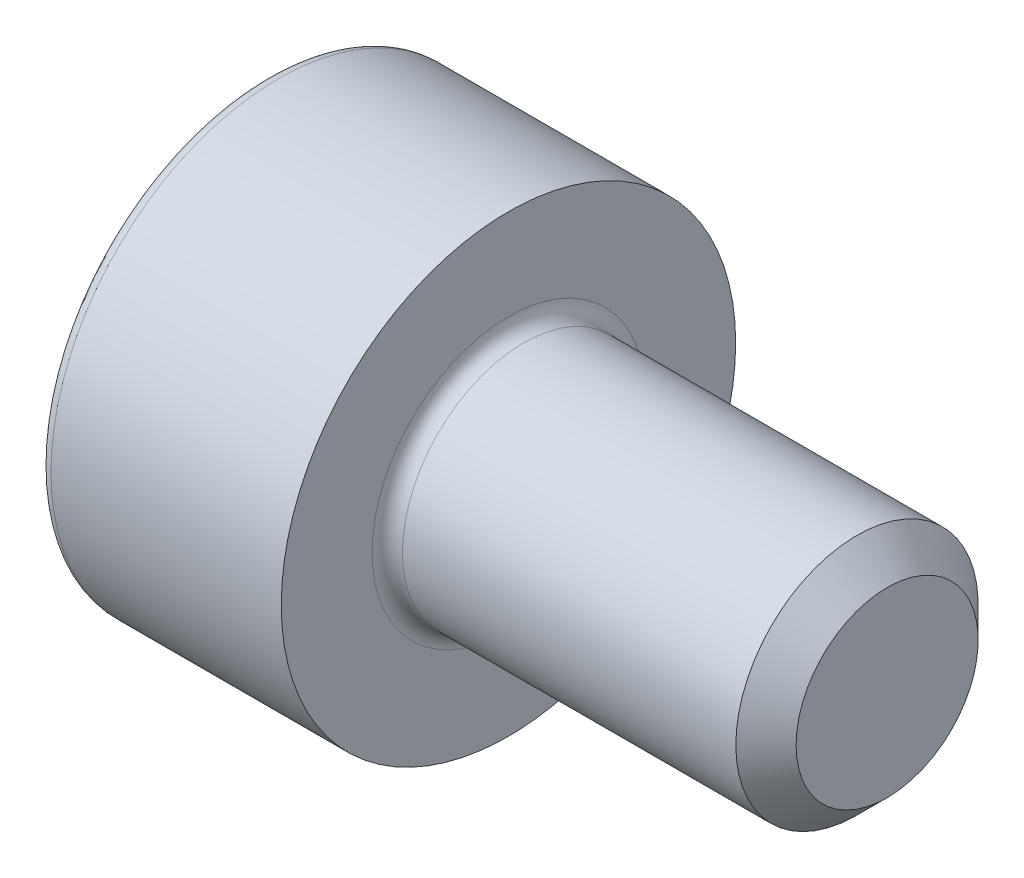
ISO-10303-21;
HEADER;
FILE_DESCRIPTION(('STEP AP214'),'2;1');
FILE_NAME('part.step','',(''),(''),'','','');
FILE_SCHEMA(('AUTOMOTIVE_DESIGN { 1 0 10303 214 1 1 1 1 }'));
ENDSEC;
DATA;
#1=APPLICATION_CONTEXT('core data for automotive mechanical design processes');
#2=APPLICATION_PROTOCOL_DEFINITION('international standard','automotive_design',2000,#1);
#3=PRODUCT_CONTEXT('',#1,'mechanical');
#4=PRODUCT('Part','Part','',(#3));
#5=PRODUCT_RELATED_PRODUCT_CATEGORY('part','',(#4));
#6=PRODUCT_DEFINITION_FORMATION('','',#4);
#7=PRODUCT_DEFINITION_CONTEXT('part definition',#1,'design');
#8=PRODUCT_DEFINITION('design','',#6,#7);
#9=PRODUCT_DEFINITION_SHAPE('','',#8);
#10=(LENGTH_UNIT() NAMED_UNIT(*) SI_UNIT(.MILLI.,.METRE.));
#11=(NAMED_UNIT(*) PLANE_ANGLE_UNIT() SI_UNIT($,.RADIAN.));
#12=(NAMED_UNIT(*) SI_UNIT($,.STERADIAN.) SOLID_ANGLE_UNIT());
#13=UNCERTAINTY_MEASURE_WITH_UNIT(LENGTH_MEASURE(1.E-05),#10,'distance_accuracy_value','');
#14=(GEOMETRIC_REPRESENTATION_CONTEXT(3) GLOBAL_UNCERTAINTY_ASSIGNED_CONTEXT((#13)) GLOBAL_UNIT_ASSIGNED_CONTEXT((#10,
#11,#12)) REPRESENTATION_CONTEXT('',''));
#15=CARTESIAN_POINT('',(0.,0.,0.));
#16=DIRECTION('',(0.,0.,1.));
#17=DIRECTION('',(1.,0.,0.));
#18=AXIS2_PLACEMENT_3D('',#15,#16,#17);
#19=CARTESIAN_POINT('',(0.7,1.29903810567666,0.75));
#20=DIRECTION('',(1.,0.,0.));
#21=DIRECTION('',(0.,0.,-1.));
#22=AXIS2_PLACEMENT_3D('',#19,#20,#21);
#23=PLANE('',#22);
#24=CARTESIAN_POINT('',(0.7,0.,0.));
#25=DIRECTION('',(1.,0.,0.));
#26=DIRECTION('',(0.,0.,-1.));
#27=AXIS2_PLACEMENT_3D('',#24,#25,#26);
#28=CIRCLE('',#27,0.75);
#29=CARTESIAN_POINT('',(0.7,0.,-0.75));
#30=VERTEX_POINT('',#29);
#31=CARTESIAN_POINT('',(0.7,-0.649519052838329,-0.375));
#32=VERTEX_POINT('',#31);
#33=EDGE_CURVE('E11',#30,#32,#28,.F.);
#34=ORIENTED_EDGE('',*,*,#33,.F.);
#35=DIRECTION('',(0.,1.,0.));
#36=VECTOR('',#35,1.);
#37=CARTESIAN_POINT('',(0.7,-0.43301270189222,-0.75));
#38=LINE('',#37,#36);
#39=CARTESIAN_POINT('',(0.7,-0.43301270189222,-0.75));
#40=VERTEX_POINT('',#39);
#41=EDGE_CURVE('E177',#40,#30,#38,.T.);
#42=ORIENTED_EDGE('',*,*,#41,.F.);
#43=DIRECTION('',(0.,0.5,-0.866025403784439));
#44=VECTOR('',#43,1.);
#45=CARTESIAN_POINT('',(0.7,-0.866025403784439,0.));
#46=LINE('',#45,#44);
#47=EDGE_CURVE('E173',#32,#40,#46,.T.);
#48=ORIENTED_EDGE('',*,*,#47,.F.);
#49=EDGE_LOOP('',(#34,#42,#48));
#50=FACE_BOUND('',#49,.T.);
#51=ADVANCED_FACE('F33',(#50),#23,.F.);
#52=CARTESIAN_POINT('',(0.7,-0.649519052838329,0.375));
#53=VERTEX_POINT('',#52);
#54=EDGE_CURVE('E42',#32,#53,#28,.F.);
#55=ORIENTED_EDGE('',*,*,#54,.F.);
#56=CARTESIAN_POINT('',(0.7,-0.866025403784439,0.));
#57=VERTEX_POINT('',#56);
#58=EDGE_CURVE('E174',#57,#32,#46,.T.);
#59=ORIENTED_EDGE('',*,*,#58,.F.);
#60=DIRECTION('',(0.,-0.5,-0.866025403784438));
#61=VECTOR('',#60,1.);
#62=CARTESIAN_POINT('',(0.7,-0.433012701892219,0.75));
#63=LINE('',#62,#61);
#64=EDGE_CURVE('E169',#53,#57,#63,.T.);
#65=ORIENTED_EDGE('',*,*,#64,.F.);
#66=EDGE_LOOP('',(#55,#59,#65));
#67=FACE_BOUND('',#66,.T.);
#68=ADVANCED_FACE('F117',(#67),#23,.F.);
#69=CARTESIAN_POINT('',(0.7,0.,0.75));
#70=VERTEX_POINT('',#69);
#71=EDGE_CURVE('E253',#53,#70,#28,.F.);
#72=ORIENTED_EDGE('',*,*,#71,.F.);
#73=CARTESIAN_POINT('',(0.7,-0.433012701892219,0.75));
#74=VERTEX_POINT('',#73);
#75=EDGE_CURVE('E170',#74,#53,#63,.T.);
#76=ORIENTED_EDGE('',*,*,#75,.F.);
#77=DIRECTION('',(0.,-1.,0.));
#78=VECTOR('',#77,1.);
#79=CARTESIAN_POINT('',(0.7,0.433012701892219,0.75));
#80=LINE('',#79,#78);
#81=EDGE_CURVE('E165',#70,#74,#80,.T.);
#82=ORIENTED_EDGE('',*,*,#81,.F.);
#83=EDGE_LOOP('',(#72,#76,#82));
#84=FACE_BOUND('',#83,.T.);
#85=ADVANCED_FACE('F123',(#84),#23,.F.);
#86=CARTESIAN_POINT('',(0.7,0.,0.));
#87=DIRECTION('',(-1.,0.,0.));
#88=DIRECTION('',(0.,0.,1.));
#89=AXIS2_PLACEMENT_3D('',#86,#87,#88);
#90=CIRCLE('',#89,0.75);
#91=CARTESIAN_POINT('',(0.7,0.649519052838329,0.375));
#92=VERTEX_POINT('',#91);
#93=EDGE_CURVE('E163',#70,#92,#90,.T.);
#94=ORIENTED_EDGE('',*,*,#93,.F.);
#95=CARTESIAN_POINT('',(0.7,0.433012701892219,0.75));
#96=VERTEX_POINT('',#95);
#97=EDGE_CURVE('E166',#96,#70,#80,.T.);
#98=ORIENTED_EDGE('',*,*,#97,.F.);
#99=DIRECTION('',(0.,-0.5,0.866025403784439));
#100=VECTOR('',#99,1.);
#101=CARTESIAN_POINT('',(0.7,0.866025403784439,0.));
#102=LINE('',#101,#100);
#103=EDGE_CURVE('E160',#92,#96,#102,.T.);
#104=ORIENTED_EDGE('',*,*,#103,.F.);
#105=EDGE_LOOP('',(#94,#98,#104));
#106=FACE_BOUND('',#105,.T.);
#107=ADVANCED_FACE('F137',(#106),#23,.F.);
#108=CARTESIAN_POINT('',(0.7,0.649519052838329,-0.375));
#109=VERTEX_POINT('',#108);
#110=EDGE_CURVE('E49',#92,#109,#28,.F.);
#111=ORIENTED_EDGE('',*,*,#110,.F.);
#112=CARTESIAN_POINT('',(0.7,0.866025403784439,0.));
#113=VERTEX_POINT('',#112);
#114=EDGE_CURVE('E151',#113,#92,#102,.T.);
#115=ORIENTED_EDGE('',*,*,#114,.F.);
#116=DIRECTION('',(0.,0.5,0.866025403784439));
#117=VECTOR('',#116,1.);
#118=CARTESIAN_POINT('',(0.7,0.43301270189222,-0.75));
#119=LINE('',#118,#117);
#120=EDGE_CURVE('E148',#109,#113,#119,.T.);
#121=ORIENTED_EDGE('',*,*,#120,.F.);
#122=EDGE_LOOP('',(#111,#115,#121));
#123=FACE_BOUND('',#122,.T.);
#124=ADVANCED_FACE('F128',(#123),#23,.F.);
#125=EDGE_CURVE('E37',#109,#30,#28,.F.);
#126=ORIENTED_EDGE('',*,*,#125,.F.);
#127=CARTESIAN_POINT('',(0.7,0.43301270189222,-0.75));
#128=VERTEX_POINT('',#127);
#129=EDGE_CURVE('E143',#128,#109,#119,.T.);
#130=ORIENTED_EDGE('',*,*,#129,.F.);
#131=EDGE_CURVE('E144',#30,#128,#38,.T.);
#132=ORIENTED_EDGE('',*,*,#131,.F.);
#133=EDGE_LOOP('',(#126,#130,#132));
#134=FACE_BOUND('',#133,.T.);
#135=ADVANCED_FACE('F119',(#134),#23,.F.);
#136=CARTESIAN_POINT('',(0.,0.,0.));
#137=DIRECTION('',(1.,0.,0.));
#138=DIRECTION('',(0.,0.,-1.));
#139=AXIS2_PLACEMENT_3D('',#136,#137,#138);
#140=PLANE('',#139);
#141=CARTESIAN_POINT('',(0.,0.,0.));
#142=DIRECTION('',(1.,0.,0.));
#143=DIRECTION('',(0.,0.,-1.));
#144=AXIS2_PLACEMENT_3D('',#141,#142,#143);
#145=CIRCLE('',#144,1.42);
#146=CARTESIAN_POINT('',(0.,0.,-1.42));
#147=VERTEX_POINT('',#146);
#148=EDGE_CURVE('E220',#147,#147,#145,.F.);
#149=ORIENTED_EDGE('',*,*,#148,.T.);
#150=EDGE_LOOP('',(#149));
#151=FACE_BOUND('',#150,.T.);
#152=DIRECTION('',(0.,0.5,0.866025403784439));
#153=VECTOR('',#152,1.);
#154=CARTESIAN_POINT('',(0.,0.43301270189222,-0.75));
#155=LINE('',#154,#153);
#156=CARTESIAN_POINT('',(0.,0.43301270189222,-0.75));
#157=VERTEX_POINT('',#156);
#158=CARTESIAN_POINT('',(0.,0.866025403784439,0.));
#159=VERTEX_POINT('',#158);
#160=EDGE_CURVE('E179',#157,#159,#155,.T.);
#161=ORIENTED_EDGE('',*,*,#160,.T.);
#162=DIRECTION('',(0.,-0.5,0.866025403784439));
#163=VECTOR('',#162,1.);
#164=CARTESIAN_POINT('',(0.,0.866025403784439,0.));
#165=LINE('',#164,#163);
#166=CARTESIAN_POINT('',(0.,0.433012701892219,0.75));
#167=VERTEX_POINT('',#166);
#168=EDGE_CURVE('E181',#159,#167,#165,.T.);
#169=ORIENTED_EDGE('',*,*,#168,.T.);
#170=DIRECTION('',(0.,-1.,0.));
#171=VECTOR('',#170,1.);
#172=CARTESIAN_POINT('',(0.,0.433012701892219,0.75));
#173=LINE('',#172,#171);
#174=CARTESIAN_POINT('',(0.,-0.433012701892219,0.75));
#175=VERTEX_POINT('',#174);
#176=EDGE_CURVE('E183',#167,#175,#173,.T.);
#177=ORIENTED_EDGE('',*,*,#176,.T.);
#178=DIRECTION('',(0.,-0.5,-0.866025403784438));
#179=VECTOR('',#178,1.);
#180=CARTESIAN_POINT('',(0.,-0.433012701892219,0.75));
#181=LINE('',#180,#179);
#182=CARTESIAN_POINT('',(0.,-0.866025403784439,0.));
#183=VERTEX_POINT('',#182);
#184=EDGE_CURVE('E185',#175,#183,#181,.T.);
#185=ORIENTED_EDGE('',*,*,#184,.T.);
#186=DIRECTION('',(0.,0.5,-0.866025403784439));
#187=VECTOR('',#186,1.);
#188=CARTESIAN_POINT('',(0.,-0.866025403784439,0.));
#189=LINE('',#188,#187);
#190=CARTESIAN_POINT('',(0.,-0.43301270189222,-0.75));
#191=VERTEX_POINT('',#190);
#192=EDGE_CURVE('E187',#183,#191,#189,.T.);
#193=ORIENTED_EDGE('',*,*,#192,.T.);
#194=DIRECTION('',(0.,1.,0.));
#195=VECTOR('',#194,1.);
#196=CARTESIAN_POINT('',(0.,-0.43301270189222,-0.75));
#197=LINE('',#196,#195);
#198=EDGE_CURVE('E57',#191,#157,#197,.T.);
#199=ORIENTED_EDGE('',*,*,#198,.T.);
#200=EDGE_LOOP('',(#161,#169,#177,#185,#193,#199));
#201=FACE_BOUND('',#200,.T.);
#202=ADVANCED_FACE('F127',(#151,#201),#140,.F.);
#203=CARTESIAN_POINT('',(0.,0.,0.));
#204=DIRECTION('',(-1.,0.,0.));
#205=DIRECTION('',(0.,0.,1.));
#206=AXIS2_PLACEMENT_3D('',#203,#204,#205);
#207=CYLINDRICAL_SURFACE('',#206,1.5);
#208=CARTESIAN_POINT('',(0.08,0.,0.));
#209=DIRECTION('',(1.,0.,0.));
#210=DIRECTION('',(0.,0.,-1.));
#211=AXIS2_PLACEMENT_3D('',#208,#209,#210);
#212=CIRCLE('',#211,1.5);
#213=CARTESIAN_POINT('',(0.08,0.,-1.5));
#214=VERTEX_POINT('',#213);
#215=EDGE_CURVE('E146',#214,#214,#212,.T.);
#216=ORIENTED_EDGE('',*,*,#215,.T.);
#217=EDGE_LOOP('',(#216));
#218=FACE_BOUND('',#217,.T.);
#219=CARTESIAN_POINT('',(1.6,0.,0.));
#220=DIRECTION('',(-1.,0.,0.));
#221=DIRECTION('',(0.,0.,1.));
#222=AXIS2_PLACEMENT_3D('',#219,#220,#221);
#223=CIRCLE('',#222,1.5);
#224=CARTESIAN_POINT('',(1.6,0.,1.5));
#225=VERTEX_POINT('',#224);
#226=EDGE_CURVE('E211',#225,#225,#223,.T.);
#227=ORIENTED_EDGE('',*,*,#226,.T.);
#228=EDGE_LOOP('',(#227));
#229=FACE_BOUND('',#228,.T.);
#230=ADVANCED_FACE('F134',(#218,#229),#207,.T.);
#231=CARTESIAN_POINT('',(1.6,1.5,0.));
#232=DIRECTION('',(-1.,0.,0.));
#233=DIRECTION('',(0.,0.,1.));
#234=AXIS2_PLACEMENT_3D('',#231,#232,#233);
#235=PLANE('',#234);
#236=CARTESIAN_POINT('',(1.6,0.,0.));
#237=DIRECTION('',(-1.,0.,0.));
#238=DIRECTION('',(0.,0.,1.));
#239=AXIS2_PLACEMENT_3D('',#236,#237,#238);
#240=CIRCLE('',#239,0.9);
#241=CARTESIAN_POINT('',(1.6,0.,0.9));
#242=VERTEX_POINT('',#241);
#243=EDGE_CURVE('E214',#242,#242,#240,.T.);
#244=ORIENTED_EDGE('',*,*,#243,.T.);
#245=EDGE_LOOP('',(#244));
#246=FACE_BOUND('',#245,.T.);
#247=ORIENTED_EDGE('',*,*,#226,.F.);
#248=EDGE_LOOP('',(#247));
#249=FACE_BOUND('',#248,.T.);
#250=ADVANCED_FACE('F362',(#246,#249),#235,.F.);
#251=CARTESIAN_POINT('',(0.,0.,0.));
#252=DIRECTION('',(-1.,0.,0.));
#253=DIRECTION('',(0.,0.,1.));
#254=AXIS2_PLACEMENT_3D('',#251,#252,#253);
#255=CYLINDRICAL_SURFACE('',#254,0.8);
#256=CARTESIAN_POINT('',(1.7,0.,0.));
#257=DIRECTION('',(-1.,0.,0.));
#258=DIRECTION('',(0.,0.,1.));
#259=AXIS2_PLACEMENT_3D('',#256,#257,#258);
#260=CIRCLE('',#259,0.8);
#261=CARTESIAN_POINT('',(1.7,0.,0.8));
#262=VERTEX_POINT('',#261);
#263=EDGE_CURVE('E217',#262,#262,#260,.F.);
#264=ORIENTED_EDGE('',*,*,#263,.T.);
#265=EDGE_LOOP('',(#264));
#266=FACE_BOUND('',#265,.T.);
#267=CARTESIAN_POINT('',(3.901,0.,0.));
#268=DIRECTION('',(-1.,0.,0.));
#269=DIRECTION('',(0.,0.,1.));
#270=AXIS2_PLACEMENT_3D('',#267,#268,#269);
#271=CIRCLE('',#270,0.8);
#272=CARTESIAN_POINT('',(3.901,0.,0.8));
#273=VERTEX_POINT('',#272);
#274=EDGE_CURVE('E208',#273,#273,#271,.T.);
#275=ORIENTED_EDGE('',*,*,#274,.T.);
#276=EDGE_LOOP('',(#275));
#277=FACE_BOUND('',#276,.T.);
#278=ADVANCED_FACE('F378',(#266,#277),#255,.T.);
#279=CARTESIAN_POINT('',(4.1,0.,0.));
#280=DIRECTION('',(-1.,0.,0.));
#281=DIRECTION('',(0.,0.,1.));
#282=AXIS2_PLACEMENT_3D('',#279,#280,#281);
#283=CONICAL_SURFACE('',#282,0.601,0.785398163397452);
#284=ORIENTED_EDGE('',*,*,#274,.F.);
#285=EDGE_LOOP('',(#284));
#286=FACE_BOUND('',#285,.T.);
#287=CARTESIAN_POINT('',(4.1,0.,0.));
#288=DIRECTION('',(-1.,0.,0.));
#289=DIRECTION('',(0.,0.,1.));
#290=AXIS2_PLACEMENT_3D('',#287,#288,#289);
#291=CIRCLE('',#290,0.601);
#292=CARTESIAN_POINT('',(4.1,0.,0.601));
#293=VERTEX_POINT('',#292);
#294=EDGE_CURVE('E205',#293,#293,#291,.T.);
#295=ORIENTED_EDGE('',*,*,#294,.T.);
#296=EDGE_LOOP('',(#295));
#297=FACE_BOUND('',#296,.T.);
#298=ADVANCED_FACE('F383',(#286,#297),#283,.T.);
#299=CARTESIAN_POINT('',(4.1,0.601,0.));
#300=DIRECTION('',(-1.,0.,0.));
#301=DIRECTION('',(0.,0.,1.));
#302=AXIS2_PLACEMENT_3D('',#299,#300,#301);
#303=PLANE('',#302);
#304=ORIENTED_EDGE('',*,*,#294,.F.);
#305=EDGE_LOOP('',(#304));
#306=FACE_BOUND('',#305,.T.);
#307=ADVANCED_FACE('F371',(#306),#303,.F.);
#308=CARTESIAN_POINT('',(1.7,0.,0.));
#309=DIRECTION('',(-1.,0.,0.));
#310=DIRECTION('',(0.,0.,1.));
#311=AXIS2_PLACEMENT_3D('',#308,#309,#310);
#312=TOROIDAL_SURFACE('',#311,0.9,0.1);
#313=ORIENTED_EDGE('',*,*,#263,.F.);
#314=EDGE_LOOP('',(#313));
#315=FACE_BOUND('',#314,.T.);
#316=ORIENTED_EDGE('',*,*,#243,.F.);
#317=EDGE_LOOP('',(#316));
#318=FACE_BOUND('',#317,.T.);
#319=ADVANCED_FACE('F229',(#315,#318),#312,.F.);
#320=CARTESIAN_POINT('',(0.08,0.,0.));
#321=DIRECTION('',(1.,0.,0.));
#322=DIRECTION('',(0.,0.,-1.));
#323=AXIS2_PLACEMENT_3D('',#320,#321,#322);
#324=TOROIDAL_SURFACE('',#323,1.42,0.08);
#325=ORIENTED_EDGE('',*,*,#215,.F.);
#326=EDGE_LOOP('',(#325));
#327=FACE_BOUND('',#326,.T.);
#328=ORIENTED_EDGE('',*,*,#148,.F.);
#329=EDGE_LOOP('',(#328));
#330=FACE_BOUND('',#329,.T.);
#331=ADVANCED_FACE('F35',(#327,#330),#324,.T.);
#332=CARTESIAN_POINT('',(0.7,0.43301270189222,-0.75));
#333=DIRECTION('',(0.,-0.866025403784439,0.5));
#334=DIRECTION('',(0.,-0.5,-0.866025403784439));
#335=AXIS2_PLACEMENT_3D('',#332,#333,#334);
#336=PLANE('',#335);
#337=ORIENTED_EDGE('',*,*,#129,.T.);
#338=ORIENTED_EDGE('',*,*,#120,.T.);
#339=DIRECTION('',(-1.,0.,0.));
#340=VECTOR('',#339,1.);
#341=CARTESIAN_POINT('',(0.7,0.866025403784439,0.));
#342=LINE('',#341,#340);
#343=EDGE_CURVE('E203',#113,#159,#342,.T.);
#344=ORIENTED_EDGE('',*,*,#343,.T.);
#345=ORIENTED_EDGE('',*,*,#160,.F.);
#346=DIRECTION('',(-1.,0.,0.));
#347=VECTOR('',#346,1.);
#348=CARTESIAN_POINT('',(0.7,0.43301270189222,-0.75));
#349=LINE('',#348,#347);
#350=EDGE_CURVE('E159',#128,#157,#349,.T.);
#351=ORIENTED_EDGE('',*,*,#350,.F.);
#352=EDGE_LOOP('',(#337,#338,#344,#345,#351));
#353=FACE_BOUND('',#352,.T.);
#354=ADVANCED_FACE('F157',(#353),#336,.T.);
#355=CARTESIAN_POINT('',(0.7,0.866025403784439,0.));
#356=DIRECTION('',(0.,-0.866025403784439,-0.5));
#357=DIRECTION('',(0.,0.5,-0.866025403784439));
#358=AXIS2_PLACEMENT_3D('',#355,#356,#357);
#359=PLANE('',#358);
#360=ORIENTED_EDGE('',*,*,#114,.T.);
#361=ORIENTED_EDGE('',*,*,#103,.T.);
#362=DIRECTION('',(-1.,0.,0.));
#363=VECTOR('',#362,1.);
#364=CARTESIAN_POINT('',(0.7,0.433012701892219,0.75));
#365=LINE('',#364,#363);
#366=EDGE_CURVE('E200',#96,#167,#365,.T.);
#367=ORIENTED_EDGE('',*,*,#366,.T.);
#368=ORIENTED_EDGE('',*,*,#168,.F.);
#369=ORIENTED_EDGE('',*,*,#343,.F.);
#370=EDGE_LOOP('',(#360,#361,#367,#368,#369));
#371=FACE_BOUND('',#370,.T.);
#372=ADVANCED_FACE('F233',(#371),#359,.T.);
#373=CARTESIAN_POINT('',(0.7,0.433012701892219,0.75));
#374=DIRECTION('',(0.,0.,-1.));
#375=DIRECTION('',(-1.,0.,0.));
#376=AXIS2_PLACEMENT_3D('',#373,#374,#375);
#377=PLANE('',#376);
#378=ORIENTED_EDGE('',*,*,#97,.T.);
#379=ORIENTED_EDGE('',*,*,#81,.T.);
#380=DIRECTION('',(-1.,0.,0.));
#381=VECTOR('',#380,1.);
#382=CARTESIAN_POINT('',(0.7,-0.433012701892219,0.75));
#383=LINE('',#382,#381);
#384=EDGE_CURVE('E197',#74,#175,#383,.T.);
#385=ORIENTED_EDGE('',*,*,#384,.T.);
#386=ORIENTED_EDGE('',*,*,#176,.F.);
#387=ORIENTED_EDGE('',*,*,#366,.F.);
#388=EDGE_LOOP('',(#378,#379,#385,#386,#387));
#389=FACE_BOUND('',#388,.T.);
#390=ADVANCED_FACE('F238',(#389),#377,.T.);
#391=CARTESIAN_POINT('',(0.7,-0.433012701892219,0.75));
#392=DIRECTION('',(0.,0.866025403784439,-0.5));
#393=DIRECTION('',(0.,0.5,0.866025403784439));
#394=AXIS2_PLACEMENT_3D('',#391,#392,#393);
#395=PLANE('',#394);
#396=ORIENTED_EDGE('',*,*,#75,.T.);
#397=ORIENTED_EDGE('',*,*,#64,.T.);
#398=DIRECTION('',(-1.,0.,0.));
#399=VECTOR('',#398,1.);
#400=CARTESIAN_POINT('',(0.7,-0.866025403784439,0.));
#401=LINE('',#400,#399);
#402=EDGE_CURVE('E194',#57,#183,#401,.T.);
#403=ORIENTED_EDGE('',*,*,#402,.T.);
#404=ORIENTED_EDGE('',*,*,#184,.F.);
#405=ORIENTED_EDGE('',*,*,#384,.F.);
#406=EDGE_LOOP('',(#396,#397,#403,#404,#405));
#407=FACE_BOUND('',#406,.T.);
#408=ADVANCED_FACE('F244',(#407),#395,.T.);
#409=CARTESIAN_POINT('',(0.7,-0.866025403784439,0.));
#410=DIRECTION('',(0.,0.866025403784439,0.5));
#411=DIRECTION('',(0.,-0.5,0.866025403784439));
#412=AXIS2_PLACEMENT_3D('',#409,#410,#411);
#413=PLANE('',#412);
#414=ORIENTED_EDGE('',*,*,#58,.T.);
#415=ORIENTED_EDGE('',*,*,#47,.T.);
#416=DIRECTION('',(-1.,0.,0.));
#417=VECTOR('',#416,1.);
#418=CARTESIAN_POINT('',(0.7,-0.43301270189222,-0.75));
#419=LINE('',#418,#417);
#420=EDGE_CURVE('E191',#40,#191,#419,.T.);
#421=ORIENTED_EDGE('',*,*,#420,.T.);
#422=ORIENTED_EDGE('',*,*,#192,.F.);
#423=ORIENTED_EDGE('',*,*,#402,.F.);
#424=EDGE_LOOP('',(#414,#415,#421,#422,#423));
#425=FACE_BOUND('',#424,.T.);
#426=ADVANCED_FACE('F112',(#425),#413,.T.);
#427=CARTESIAN_POINT('',(0.7,-0.43301270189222,-0.75));
#428=DIRECTION('',(0.,0.,1.));
#429=DIRECTION('',(1.,0.,0.));
#430=AXIS2_PLACEMENT_3D('',#427,#428,#429);
#431=PLANE('',#430);
#432=ORIENTED_EDGE('',*,*,#41,.T.);
#433=ORIENTED_EDGE('',*,*,#131,.T.);
#434=ORIENTED_EDGE('',*,*,#350,.T.);
#435=ORIENTED_EDGE('',*,*,#198,.F.);
#436=ORIENTED_EDGE('',*,*,#420,.F.);
#437=EDGE_LOOP('',(#432,#433,#434,#435,#436));
#438=FACE_BOUND('',#437,.T.);
#439=ADVANCED_FACE('F107',(#438),#431,.T.);
#440=CARTESIAN_POINT('',(1.13301270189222,0.,0.));
#441=DIRECTION('',(-1.,0.,0.));
#442=DIRECTION('',(0.,0.,1.));
#443=AXIS2_PLACEMENT_3D('',#440,#441,#442);
#444=CONICAL_SURFACE('',#443,0.,1.04719755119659);
#445=ORIENTED_EDGE('',*,*,#93,.T.);
#446=ORIENTED_EDGE('',*,*,#110,.T.);
#447=ORIENTED_EDGE('',*,*,#125,.T.);
#448=ORIENTED_EDGE('',*,*,#33,.T.);
#449=ORIENTED_EDGE('',*,*,#54,.T.);
#450=ORIENTED_EDGE('',*,*,#71,.T.);
#451=EDGE_LOOP('',(#445,#446,#447,#448,#449,#450));
#452=FACE_BOUND('',#451,.T.);
#453=CARTESIAN_POINT('',(1.13301270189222,0.,0.));
#454=VERTEX_POINT('',#453);
#455=VERTEX_LOOP('',#454);
#456=FACE_BOUND('',#455,.T.);
#457=ADVANCED_FACE('F105',(#452,#456),#444,.F.);
#458=CLOSED_SHELL('',(#51,#68,#85,#107,#124,#135,#202,#230,#250,#278,#298,#307,#319,#331,#354,
#372,#390,#408,#426,#439,#457));
#459=MANIFOLD_SOLID_BREP('B2',#458);
#460=ADVANCED_BREP_SHAPE_REPRESENTATION('',(#18,#459),#14);
#461=SHAPE_DEFINITION_REPRESENTATION(#9,#460);
ENDSEC;
END-ISO-10303-21;
